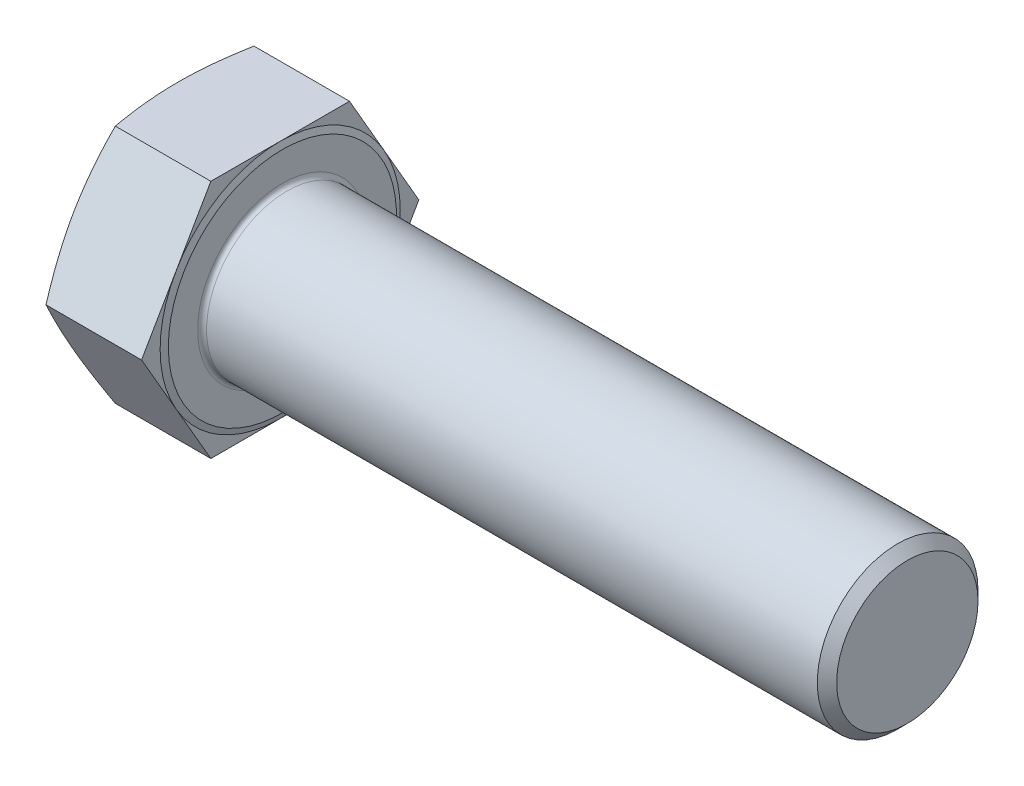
ISO-10303-21;
HEADER;
FILE_DESCRIPTION(('STEP AP214'),'2;1');
FILE_NAME('part.step','',(''),(''),'','','');
FILE_SCHEMA(('AUTOMOTIVE_DESIGN { 1 0 10303 214 1 1 1 1 }'));
ENDSEC;
DATA;
#1=APPLICATION_CONTEXT('core data for automotive mechanical design processes');
#2=APPLICATION_PROTOCOL_DEFINITION('international standard','automotive_design',2000,#1);
#3=PRODUCT_CONTEXT('',#1,'mechanical');
#4=PRODUCT('Part','Part','',(#3));
#5=PRODUCT_RELATED_PRODUCT_CATEGORY('part','',(#4));
#6=PRODUCT_DEFINITION_FORMATION('','',#4);
#7=PRODUCT_DEFINITION_CONTEXT('part definition',#1,'design');
#8=PRODUCT_DEFINITION('design','',#6,#7);
#9=PRODUCT_DEFINITION_SHAPE('','',#8);
#10=(LENGTH_UNIT() NAMED_UNIT(*) SI_UNIT(.MILLI.,.METRE.));
#11=(NAMED_UNIT(*) PLANE_ANGLE_UNIT() SI_UNIT($,.RADIAN.));
#12=(NAMED_UNIT(*) SI_UNIT($,.STERADIAN.) SOLID_ANGLE_UNIT());
#13=UNCERTAINTY_MEASURE_WITH_UNIT(LENGTH_MEASURE(1.E-05),#10,'distance_accuracy_value','');
#14=(GEOMETRIC_REPRESENTATION_CONTEXT(3) GLOBAL_UNCERTAINTY_ASSIGNED_CONTEXT((#13)) GLOBAL_UNIT_ASSIGNED_CONTEXT((#10,
#11,#12)) REPRESENTATION_CONTEXT('',''));
#15=CARTESIAN_POINT('',(0.,0.,0.));
#16=DIRECTION('',(0.,0.,1.));
#17=DIRECTION('',(1.,0.,0.));
#18=AXIS2_PLACEMENT_3D('',#15,#16,#17);
#19=CARTESIAN_POINT('',(23.42,0.,0.));
#20=DIRECTION('',(1.,0.,0.));
#21=DIRECTION('',(0.,0.,-1.));
#22=AXIS2_PLACEMENT_3D('',#19,#20,#21);
#23=PLANE('',#22);
#24=CARTESIAN_POINT('',(23.42,0.,0.));
#25=DIRECTION('',(1.,0.,0.));
#26=DIRECTION('',(0.,0.,-1.));
#27=AXIS2_PLACEMENT_3D('',#24,#25,#26);
#28=CIRCLE('',#27,19.);
#29=CARTESIAN_POINT('',(23.42,0.,-19.));
#30=VERTEX_POINT('',#29);
#31=EDGE_CURVE('E188',#30,#30,#28,.F.);
#32=ORIENTED_EDGE('',*,*,#31,.T.);
#33=EDGE_LOOP('',(#32));
#34=FACE_BOUND('',#33,.T.);
#35=CARTESIAN_POINT('',(23.42,0.,0.));
#36=DIRECTION('',(-1.,0.,0.));
#37=DIRECTION('',(0.,0.,1.));
#38=AXIS2_PLACEMENT_3D('',#35,#36,#37);
#39=CIRCLE('',#38,25.555);
#40=CARTESIAN_POINT('',(23.42,0.,25.555));
#41=VERTEX_POINT('',#40);
#42=EDGE_CURVE('E139',#41,#41,#39,.T.);
#43=ORIENTED_EDGE('',*,*,#42,.F.);
#44=EDGE_LOOP('',(#43));
#45=FACE_BOUND('',#44,.T.);
#46=ADVANCED_FACE('F33',(#34,#45),#23,.T.);
#47=CARTESIAN_POINT('',(22.92,0.,-31.0614444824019));
#48=DIRECTION('',(1.,0.,0.));
#49=DIRECTION('',(0.,0.,-1.));
#50=AXIS2_PLACEMENT_3D('',#47,#48,#49);
#51=PLANE('',#50);
#52=DIRECTION('',(0.,-0.866025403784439,0.5));
#53=VECTOR('',#52,1.);
#54=CARTESIAN_POINT('',(22.92,26.9,15.5307222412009));
#55=LINE('',#54,#53);
#56=CARTESIAN_POINT('',(22.92,26.9,15.5307222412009));
#57=VERTEX_POINT('',#56);
#58=CARTESIAN_POINT('',(22.92,13.45,23.2960833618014));
#59=VERTEX_POINT('',#58);
#60=EDGE_CURVE('E138',#57,#59,#55,.T.);
#61=ORIENTED_EDGE('',*,*,#60,.T.);
#62=CARTESIAN_POINT('',(22.92,0.,0.));
#63=DIRECTION('',(-1.,0.,0.));
#64=DIRECTION('',(0.,0.,1.));
#65=AXIS2_PLACEMENT_3D('',#62,#63,#64);
#66=CIRCLE('',#65,26.9);
#67=CARTESIAN_POINT('',(22.92,26.9,0.));
#68=VERTEX_POINT('',#67);
#69=EDGE_CURVE('E49',#59,#68,#66,.T.);
#70=ORIENTED_EDGE('',*,*,#69,.T.);
#71=DIRECTION('',(0.,0.,1.));
#72=VECTOR('',#71,1.);
#73=CARTESIAN_POINT('',(22.92,26.9,-15.5307222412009));
#74=LINE('',#73,#72);
#75=EDGE_CURVE('E135',#68,#57,#74,.T.);
#76=ORIENTED_EDGE('',*,*,#75,.T.);
#77=EDGE_LOOP('',(#61,#70,#76));
#78=FACE_BOUND('',#77,.T.);
#79=ADVANCED_FACE('F134',(#78),#51,.T.);
#80=CARTESIAN_POINT('',(22.92,26.9,-15.5307222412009));
#81=VERTEX_POINT('',#80);
#82=EDGE_CURVE('E145',#81,#68,#74,.T.);
#83=ORIENTED_EDGE('',*,*,#82,.T.);
#84=CARTESIAN_POINT('',(22.92,13.45,-23.2960833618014));
#85=VERTEX_POINT('',#84);
#86=EDGE_CURVE('E122',#68,#85,#66,.T.);
#87=ORIENTED_EDGE('',*,*,#86,.T.);
#88=DIRECTION('',(0.,0.866025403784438,0.5));
#89=VECTOR('',#88,1.);
#90=CARTESIAN_POINT('',(22.92,0.,-31.0614444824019));
#91=LINE('',#90,#89);
#92=EDGE_CURVE('E151',#85,#81,#91,.T.);
#93=ORIENTED_EDGE('',*,*,#92,.T.);
#94=EDGE_LOOP('',(#83,#87,#93));
#95=FACE_BOUND('',#94,.T.);
#96=ADVANCED_FACE('F150',(#95),#51,.T.);
#97=CARTESIAN_POINT('',(22.92,0.,-31.0614444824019));
#98=VERTEX_POINT('',#97);
#99=EDGE_CURVE('E148',#98,#85,#91,.T.);
#100=ORIENTED_EDGE('',*,*,#99,.T.);
#101=CARTESIAN_POINT('',(22.92,-13.45,-23.2960833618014));
#102=VERTEX_POINT('',#101);
#103=EDGE_CURVE('E125',#85,#102,#66,.T.);
#104=ORIENTED_EDGE('',*,*,#103,.T.);
#105=DIRECTION('',(0.,0.866025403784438,-0.5));
#106=VECTOR('',#105,1.);
#107=CARTESIAN_POINT('',(22.92,-26.9,-15.530722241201));
#108=LINE('',#107,#106);
#109=EDGE_CURVE('E306',#102,#98,#108,.T.);
#110=ORIENTED_EDGE('',*,*,#109,.T.);
#111=EDGE_LOOP('',(#100,#104,#110));
#112=FACE_BOUND('',#111,.T.);
#113=ADVANCED_FACE('F337',(#112),#51,.T.);
#114=CARTESIAN_POINT('',(22.92,-26.9,-15.530722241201));
#115=VERTEX_POINT('',#114);
#116=EDGE_CURVE('E304',#115,#102,#108,.T.);
#117=ORIENTED_EDGE('',*,*,#116,.T.);
#118=CARTESIAN_POINT('',(22.92,-26.9,0.));
#119=VERTEX_POINT('',#118);
#120=EDGE_CURVE('E338',#102,#119,#66,.T.);
#121=ORIENTED_EDGE('',*,*,#120,.T.);
#122=DIRECTION('',(0.,0.,-1.));
#123=VECTOR('',#122,1.);
#124=CARTESIAN_POINT('',(22.92,-26.9,15.5307222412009));
#125=LINE('',#124,#123);
#126=EDGE_CURVE('E162',#119,#115,#125,.T.);
#127=ORIENTED_EDGE('',*,*,#126,.T.);
#128=EDGE_LOOP('',(#117,#121,#127));
#129=FACE_BOUND('',#128,.T.);
#130=ADVANCED_FACE('F352',(#129),#51,.T.);
#131=CARTESIAN_POINT('',(22.92,-26.9,15.5307222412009));
#132=VERTEX_POINT('',#131);
#133=EDGE_CURVE('E163',#132,#119,#125,.T.);
#134=ORIENTED_EDGE('',*,*,#133,.T.);
#135=CARTESIAN_POINT('',(22.92,-13.45,23.2960833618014));
#136=VERTEX_POINT('',#135);
#137=EDGE_CURVE('E339',#119,#136,#66,.T.);
#138=ORIENTED_EDGE('',*,*,#137,.T.);
#139=DIRECTION('',(0.,-0.866025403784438,-0.5));
#140=VECTOR('',#139,1.);
#141=CARTESIAN_POINT('',(22.92,0.,31.0614444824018));
#142=LINE('',#141,#140);
#143=EDGE_CURVE('E158',#136,#132,#142,.T.);
#144=ORIENTED_EDGE('',*,*,#143,.T.);
#145=EDGE_LOOP('',(#134,#138,#144));
#146=FACE_BOUND('',#145,.T.);
#147=ADVANCED_FACE('F347',(#146),#51,.T.);
#148=CARTESIAN_POINT('',(22.92,0.,31.0614444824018));
#149=VERTEX_POINT('',#148);
#150=EDGE_CURVE('E159',#149,#136,#142,.T.);
#151=ORIENTED_EDGE('',*,*,#150,.T.);
#152=EDGE_CURVE('E140',#136,#59,#66,.T.);
#153=ORIENTED_EDGE('',*,*,#152,.T.);
#154=EDGE_CURVE('E153',#59,#149,#55,.T.);
#155=ORIENTED_EDGE('',*,*,#154,.T.);
#156=EDGE_LOOP('',(#151,#153,#155));
#157=FACE_BOUND('',#156,.T.);
#158=ADVANCED_FACE('F213',(#157),#51,.T.);
#159=CARTESIAN_POINT('',(22.92,-26.9,-15.530722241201));
#160=DIRECTION('',(0.,0.5,0.866025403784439));
#161=DIRECTION('',(0.,-0.866025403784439,0.5));
#162=AXIS2_PLACEMENT_3D('',#159,#160,#161);
#163=PLANE('',#162);
#164=CARTESIAN_POINT('',(1.51468395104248,0.000200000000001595,-31.0615599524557));
#165=CARTESIAN_POINT('',(1.397628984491,-0.556880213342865,-30.739929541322));
#166=CARTESIAN_POINT('',(1.2858383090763,-1.11477913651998,-30.4178264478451));
#167=CARTESIAN_POINT('',(1.07394359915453,-2.23229041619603,-29.7726310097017));
#168=CARTESIAN_POINT('',(0.973840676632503,-2.79190293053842,-29.4495385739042));
#169=CARTESIAN_POINT('',(0.692703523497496,-4.47404053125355,-28.4783559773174));
#170=CARTESIAN_POINT('',(0.531005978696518,-5.59909558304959,-27.8288051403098));
#171=CARTESIAN_POINT('',(0.334493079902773,-7.28525346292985,-26.8553014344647));
#172=CARTESIAN_POINT('',(0.276827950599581,-7.84441085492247,-26.5324717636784));
#173=CARTESIAN_POINT('',(0.1772419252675,-8.96379540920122,-25.8861947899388));
#174=CARTESIAN_POINT('',(0.135321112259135,-9.52402257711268,-25.5627474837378));
#175=CARTESIAN_POINT('',(0.0679605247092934,-10.6450156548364,-24.9155418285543));
#176=CARTESIAN_POINT('',(0.0425147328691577,-11.2057812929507,-24.5917836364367));
#177=CARTESIAN_POINT('',(0.00853449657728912,-12.3276979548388,-23.9440447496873));
#178=CARTESIAN_POINT('',(0.,-12.8888489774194,-23.6200640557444));
#179=CARTESIAN_POINT('',(0.,-14.0111510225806,-22.9721026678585));
#180=CARTESIAN_POINT('',(0.00853449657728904,-14.5723020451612,-22.6481219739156));
#181=CARTESIAN_POINT('',(0.0425147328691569,-15.6942187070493,-22.0003830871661));
#182=CARTESIAN_POINT('',(0.0679605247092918,-16.2549843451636,-21.6766248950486));
#183=CARTESIAN_POINT('',(0.135321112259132,-17.3759774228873,-21.029419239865));
#184=CARTESIAN_POINT('',(0.177241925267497,-17.9362045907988,-20.705971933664));
#185=CARTESIAN_POINT('',(0.276827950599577,-19.0555891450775,-20.0596949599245));
#186=CARTESIAN_POINT('',(0.33449307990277,-19.6147465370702,-19.7368652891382));
#187=CARTESIAN_POINT('',(0.531005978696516,-21.3009044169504,-18.7633615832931));
#188=CARTESIAN_POINT('',(0.692703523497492,-22.4259594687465,-18.1138107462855));
#189=CARTESIAN_POINT('',(0.973840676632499,-24.1080970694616,-17.1426281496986));
#190=CARTESIAN_POINT('',(1.07394359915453,-24.667709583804,-16.8195357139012));
#191=CARTESIAN_POINT('',(1.28583830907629,-25.78522086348,-16.1743402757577));
#192=CARTESIAN_POINT('',(1.39762898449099,-26.3431197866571,-15.8522371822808));
#193=CARTESIAN_POINT('',(1.51468395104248,-26.9002,-15.5306067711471));
#194=B_SPLINE_CURVE_WITH_KNOTS('',3,(#164,#165,#166,#167,#168,#169,#170,#171,#172,#173,#174,
#175,#176,#177,#178,#179,#180,#181,#182,#183,#184,#185,#186,#187,#188,#189,#190,#191,#192,#193),
.UNSPECIFIED.,.F.,.F.,(4,2,2,2,2,2,2,2,2,2,2,2,2,2,4),(0.,1.96141494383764,3.92301634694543,
7.84893078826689,9.79346540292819,11.7380102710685,13.6818445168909,15.6256727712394,
17.569501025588,19.5133352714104,21.4578801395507,23.402414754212,27.3283291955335,
29.2899305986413,31.2513455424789),.UNSPECIFIED.);
#195=CARTESIAN_POINT('',(1.51464192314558,0.,-31.0614444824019));
#196=VERTEX_POINT('',#195);
#197=CARTESIAN_POINT('',(0.,-13.45,-23.2960833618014));
#198=VERTEX_POINT('',#197);
#199=EDGE_CURVE('E321',#196,#198,#194,.T.);
#200=ORIENTED_EDGE('',*,*,#199,.F.);
#201=DIRECTION('',(-1.,0.,0.));
#202=VECTOR('',#201,1.);
#203=CARTESIAN_POINT('',(22.92,0.,-31.0614444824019));
#204=LINE('',#203,#202);
#205=EDGE_CURVE('E178',#98,#196,#204,.T.);
#206=ORIENTED_EDGE('',*,*,#205,.F.);
#207=ORIENTED_EDGE('',*,*,#109,.F.);
#208=ORIENTED_EDGE('',*,*,#116,.F.);
#209=DIRECTION('',(-1.,0.,0.));
#210=VECTOR('',#209,1.);
#211=CARTESIAN_POINT('',(22.92,-26.9,-15.530722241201));
#212=LINE('',#211,#210);
#213=CARTESIAN_POINT('',(1.51464192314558,-26.9,-15.530722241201));
#214=VERTEX_POINT('',#213);
#215=EDGE_CURVE('E166',#115,#214,#212,.T.);
#216=ORIENTED_EDGE('',*,*,#215,.T.);
#217=EDGE_CURVE('E246',#198,#214,#194,.T.);
#218=ORIENTED_EDGE('',*,*,#217,.F.);
#219=EDGE_LOOP('',(#200,#206,#207,#208,#216,#218));
#220=FACE_BOUND('',#219,.T.);
#221=ADVANCED_FACE('F35',(#220),#163,.F.);
#222=CARTESIAN_POINT('',(22.92,0.,-31.0614444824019));
#223=DIRECTION('',(0.,-0.5,0.866025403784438));
#224=DIRECTION('',(0.,-0.866025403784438,-0.5));
#225=AXIS2_PLACEMENT_3D('',#222,#223,#224);
#226=PLANE('',#225);
#227=CARTESIAN_POINT('',(1.51468395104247,26.9002,-15.5306067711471));
#228=CARTESIAN_POINT('',(1.39762898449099,26.3431197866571,-15.8522371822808));
#229=CARTESIAN_POINT('',(1.28583830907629,25.78522086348,-16.1743402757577));
#230=CARTESIAN_POINT('',(1.07394359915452,24.667709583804,-16.8195357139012));
#231=CARTESIAN_POINT('',(0.973840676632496,24.1080970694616,-17.1426281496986));
#232=CARTESIAN_POINT('',(0.69270352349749,22.4259594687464,-18.1138107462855));
#233=CARTESIAN_POINT('',(0.531005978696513,21.3009044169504,-18.7633615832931));
#234=CARTESIAN_POINT('',(0.334493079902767,19.6147465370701,-19.7368652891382));
#235=CARTESIAN_POINT('',(0.276827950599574,19.0555891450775,-20.0596949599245));
#236=CARTESIAN_POINT('',(0.177241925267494,17.9362045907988,-20.705971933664));
#237=CARTESIAN_POINT('',(0.135321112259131,17.3759774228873,-21.029419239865));
#238=CARTESIAN_POINT('',(0.0679605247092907,16.2549843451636,-21.6766248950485));
#239=CARTESIAN_POINT('',(0.0425147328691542,15.6942187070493,-22.0003830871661));
#240=CARTESIAN_POINT('',(0.00853449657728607,14.5723020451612,-22.6481219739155));
#241=CARTESIAN_POINT('',(0.,14.0111510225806,-22.9721026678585));
#242=CARTESIAN_POINT('',(0.,12.8888489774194,-23.6200640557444));
#243=CARTESIAN_POINT('',(0.00853449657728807,12.3276979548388,-23.9440447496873));
#244=CARTESIAN_POINT('',(0.0425147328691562,11.2057812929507,-24.5917836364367));
#245=CARTESIAN_POINT('',(0.0679605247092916,10.6450156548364,-24.9155418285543));
#246=CARTESIAN_POINT('',(0.135321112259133,9.52402257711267,-25.5627474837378));
#247=CARTESIAN_POINT('',(0.177241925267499,8.96379540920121,-25.8861947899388));
#248=CARTESIAN_POINT('',(0.27682795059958,7.84441085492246,-26.5324717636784));
#249=CARTESIAN_POINT('',(0.334493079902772,7.28525346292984,-26.8553014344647));
#250=CARTESIAN_POINT('',(0.531005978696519,5.59909558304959,-27.8288051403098));
#251=CARTESIAN_POINT('',(0.692703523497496,4.47404053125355,-28.4783559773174));
#252=CARTESIAN_POINT('',(0.973840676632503,2.79190293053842,-29.4495385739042));
#253=CARTESIAN_POINT('',(1.07394359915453,2.23229041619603,-29.7726310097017));
#254=CARTESIAN_POINT('',(1.2858383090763,1.11477913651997,-30.4178264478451));
#255=CARTESIAN_POINT('',(1.397628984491,0.556880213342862,-30.739929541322));
#256=CARTESIAN_POINT('',(1.51468395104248,-0.000200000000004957,-31.0615599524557));
#257=B_SPLINE_CURVE_WITH_KNOTS('',3,(#227,#228,#229,#230,#231,#232,#233,#234,#235,#236,#237,
#238,#239,#240,#241,#242,#243,#244,#245,#246,#247,#248,#249,#250,#251,#252,#253,#254,#255,#256),
.UNSPECIFIED.,.F.,.F.,(4,2,2,2,2,2,2,2,2,2,2,2,2,2,4),(0.,1.96141494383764,3.92301634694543,
7.84893078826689,9.79346540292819,11.7380102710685,13.6818445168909,15.6256727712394,
17.569501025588,19.5133352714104,21.4578801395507,23.402414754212,27.3283291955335,
29.2899305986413,31.2513455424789),.UNSPECIFIED.);
#258=CARTESIAN_POINT('',(1.51464192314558,26.9,-15.530722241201));
#259=VERTEX_POINT('',#258);
#260=CARTESIAN_POINT('',(0.,13.45,-23.2960833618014));
#261=VERTEX_POINT('',#260);
#262=EDGE_CURVE('E261',#259,#261,#257,.T.);
#263=ORIENTED_EDGE('',*,*,#262,.F.);
#264=DIRECTION('',(-1.,0.,0.));
#265=VECTOR('',#264,1.);
#266=CARTESIAN_POINT('',(22.92,26.9,-15.5307222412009));
#267=LINE('',#266,#265);
#268=EDGE_CURVE('E176',#81,#259,#267,.T.);
#269=ORIENTED_EDGE('',*,*,#268,.F.);
#270=ORIENTED_EDGE('',*,*,#92,.F.);
#271=ORIENTED_EDGE('',*,*,#99,.F.);
#272=ORIENTED_EDGE('',*,*,#205,.T.);
#273=EDGE_CURVE('E257',#261,#196,#257,.T.);
#274=ORIENTED_EDGE('',*,*,#273,.F.);
#275=EDGE_LOOP('',(#263,#269,#270,#271,#272,#274));
#276=FACE_BOUND('',#275,.T.);
#277=ADVANCED_FACE('F267',(#276),#226,.F.);
#278=CARTESIAN_POINT('',(22.92,26.9,-15.5307222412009));
#279=DIRECTION('',(0.,-1.,0.));
#280=DIRECTION('',(0.,0.,-1.));
#281=AXIS2_PLACEMENT_3D('',#278,#279,#280);
#282=PLANE('',#281);
#283=CARTESIAN_POINT('',(8.09364576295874,26.9,-41.1198915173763));
#284=CARTESIAN_POINT('',(7.90830433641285,26.9,-40.5113738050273));
#285=CARTESIAN_POINT('',(7.72408376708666,26.9,-39.9025148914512));
#286=CARTESIAN_POINT('',(7.35813527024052,26.9,-38.6840447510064));
#287=CARTESIAN_POINT('',(7.17640735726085,26.9,-38.0744335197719));
#288=CARTESIAN_POINT('',(6.63531556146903,26.9,-36.2442869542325));
#289=CARTESIAN_POINT('',(6.28007109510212,26.9,-35.0225286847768));
#290=CARTESIAN_POINT('',(5.58244747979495,26.9,-32.5728705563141));
#291=CARTESIAN_POINT('',(5.24009357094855,26.9,-31.3449634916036));
#292=CARTESIAN_POINT('',(4.5722297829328,26.9,-28.8845822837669));
#293=CARTESIAN_POINT('',(4.24671960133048,26.9,-27.6521082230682));
#294=CARTESIAN_POINT('',(3.62060798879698,26.9,-25.197000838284));
#295=CARTESIAN_POINT('',(3.31974892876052,26.9,-23.9744335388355));
#296=CARTESIAN_POINT('',(2.74364501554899,26.9,-21.5232150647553));
#297=CARTESIAN_POINT('',(2.46840059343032,26.9,-20.2945637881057));
#298=CARTESIAN_POINT('',(1.94994322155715,26.9,-17.830903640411));
#299=CARTESIAN_POINT('',(1.70671934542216,26.9,-16.5958970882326));
#300=CARTESIAN_POINT('',(1.2597103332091,26.9,-14.1187102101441));
#301=CARTESIAN_POINT('',(1.05592387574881,26.9,-12.8765301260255));
#302=CARTESIAN_POINT('',(0.716241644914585,26.9,-10.5248872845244));
#303=CARTESIAN_POINT('',(0.575295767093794,26.9,-9.41615943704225));
#304=CARTESIAN_POINT('',(0.336719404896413,26.9,-7.1939724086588));
#305=CARTESIAN_POINT('',(0.239087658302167,26.9,-6.08051336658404));
#306=CARTESIAN_POINT('',(0.128593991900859,26.9,-4.40838470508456));
#307=CARTESIAN_POINT('',(0.0977591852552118,26.9,-3.85086246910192));
#308=CARTESIAN_POINT('',(0.0484239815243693,26.9,-2.73527685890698));
#309=CARTESIAN_POINT('',(0.0299232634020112,26.9,-2.17721349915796));
#310=CARTESIAN_POINT('',(0.0055107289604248,26.9,-1.06080724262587));
#311=CARTESIAN_POINT('',(-0.000400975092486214,26.9,-0.502464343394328));
#312=CARTESIAN_POINT('',(0.000443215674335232,26.9,0.614211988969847));
#313=CARTESIAN_POINT('',(0.00719911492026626,26.9,1.17254542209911));
#314=CARTESIAN_POINT('',(0.0333546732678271,26.9,2.29174099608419));
#315=CARTESIAN_POINT('',(0.0528180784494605,26.9,2.85260165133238));
#316=CARTESIAN_POINT('',(0.104180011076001,26.9,3.97375773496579));
#317=CARTESIAN_POINT('',(0.136078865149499,26.9,4.5340531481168));
#318=CARTESIAN_POINT('',(0.249841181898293,26.9,6.21369861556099));
#319=CARTESIAN_POINT('',(0.349771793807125,26.9,7.331864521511));
#320=CARTESIAN_POINT('',(0.593196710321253,26.9,9.56430663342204));
#321=CARTESIAN_POINT('',(0.736728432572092,26.9,10.6785786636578));
#322=CARTESIAN_POINT('',(1.06151792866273,26.9,12.9015599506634));
#323=CARTESIAN_POINT('',(1.24277590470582,26.9,14.0102691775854));
#324=CARTESIAN_POINT('',(1.64755311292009,26.9,16.2804519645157));
#325=CARTESIAN_POINT('',(1.87280061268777,26.9,17.4416144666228));
#326=CARTESIAN_POINT('',(2.35228601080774,26.9,19.7579775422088));
#327=CARTESIAN_POINT('',(2.60652609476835,26.9,20.9131776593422));
#328=CARTESIAN_POINT('',(3.13865846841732,26.9,23.2184379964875));
#329=CARTESIAN_POINT('',(3.41655762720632,26.9,24.3684966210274));
#330=CARTESIAN_POINT('',(3.99148746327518,26.9,26.6637692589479));
#331=CARTESIAN_POINT('',(4.28851768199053,26.9,27.8089833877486));
#332=CARTESIAN_POINT('',(4.89852507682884,26.9,30.0967168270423));
#333=CARTESIAN_POINT('',(5.21152224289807,26.9,31.2392307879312));
#334=CARTESIAN_POINT('',(5.85024897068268,26.9,33.5206892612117));
#335=CARTESIAN_POINT('',(6.17597858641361,26.9,34.6596337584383));
#336=CARTESIAN_POINT('',(6.83783976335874,26.9,36.9342824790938));
#337=CARTESIAN_POINT('',(7.1739695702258,26.9,38.069987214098));
#338=CARTESIAN_POINT('',(7.85487614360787,26.9,40.338794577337));
#339=CARTESIAN_POINT('',(8.19965289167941,26.9,41.4718972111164));
#340=CARTESIAN_POINT('',(8.89256675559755,26.9,43.7233837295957));
#341=CARTESIAN_POINT('',(9.24062474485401,26.9,44.8417919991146));
#342=CARTESIAN_POINT('',(9.94266960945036,26.9,47.0767443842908));
#343=CARTESIAN_POINT('',(10.2966564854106,26.9,48.193288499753));
#344=CARTESIAN_POINT('',(11.009668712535,26.9,50.4248218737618));
#345=CARTESIAN_POINT('',(11.3686942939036,26.9,51.5398110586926));
#346=CARTESIAN_POINT('',(12.0910295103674,26.9,53.7684011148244));
#347=CARTESIAN_POINT('',(12.4543391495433,26.9,54.8820019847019));
#348=CARTESIAN_POINT('',(13.1832494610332,26.9,57.1037718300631));
#349=CARTESIAN_POINT('',(13.5488362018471,26.9,58.211945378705));
#350=CARTESIAN_POINT('',(14.2831644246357,26.9,60.4272469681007));
#351=CARTESIAN_POINT('',(14.6519059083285,26.9,61.5343750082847));
#352=CARTESIAN_POINT('',(15.3920975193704,26.9,63.7476240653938));
#353=CARTESIAN_POINT('',(15.763547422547,26.9,64.8537451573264));
#354=CARTESIAN_POINT('',(16.5088507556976,26.9,67.065174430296));
#355=CARTESIAN_POINT('',(16.8827041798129,26.9,68.1704826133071));
#356=CARTESIAN_POINT('',(17.2575927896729,26.9,69.2754387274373));
#357=B_SPLINE_CURVE_WITH_KNOTS('',3,(#283,#284,#285,#286,#287,#288,#289,#290,#291,#292,#293,
#294,#295,#296,#297,#298,#299,#300,#301,#302,#303,#304,#305,#306,#307,#308,#309,#310,#311,#312,
#313,#314,#315,#316,#317,#318,#319,#320,#321,#322,#323,#324,#325,#326,#327,#328,#329,#330,#331,
#332,#333,#334,#335,#336,#337,#338,#339,#340,#341,#342,#343,#344,#345,#346,#347,#348,#349,#350,
#351,#352,#353,#354,#355,#356),.UNSPECIFIED.,.F.,.F.,(4,2,2,2,2,2,2,2,2,2,2,2,2,2,2,2,2,2,2,2,2,
2,2,2,2,2,2,2,2,2,2,2,2,2,2,2,4),(0.,1.90834994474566,3.81671101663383,7.63371526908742,
11.4578411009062,15.2818982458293,19.0588067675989,22.8357788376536,26.6114587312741,
30.3870120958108,33.7392539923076,37.0913981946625,38.7664069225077,40.4413720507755,
42.1163521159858,43.7913327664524,45.4747810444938,47.1582735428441,50.5250887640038,
53.8948015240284,57.2645323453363,60.8125045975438,64.3607444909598,67.9100181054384,
71.459206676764,75.0129532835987,78.5667149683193,82.119880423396,85.6730383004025,
89.1869673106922,92.700896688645,96.214987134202,99.7290809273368,103.229835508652,
106.730591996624,110.231061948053,113.731523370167),.UNSPECIFIED.);
#358=CARTESIAN_POINT('',(1.51464192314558,26.9000000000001,15.5307222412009));
#359=VERTEX_POINT('',#358);
#360=CARTESIAN_POINT('',(0.,26.9,0.));
#361=VERTEX_POINT('',#360);
#362=EDGE_CURVE('E57',#359,#361,#357,.F.);
#363=ORIENTED_EDGE('',*,*,#362,.F.);
#364=DIRECTION('',(-1.,0.,0.));
#365=VECTOR('',#364,1.);
#366=CARTESIAN_POINT('',(22.92,26.9,15.5307222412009));
#367=LINE('',#366,#365);
#368=EDGE_CURVE('E147',#57,#359,#367,.T.);
#369=ORIENTED_EDGE('',*,*,#368,.F.);
#370=ORIENTED_EDGE('',*,*,#75,.F.);
#371=ORIENTED_EDGE('',*,*,#82,.F.);
#372=ORIENTED_EDGE('',*,*,#268,.T.);
#373=EDGE_CURVE('E262',#361,#259,#357,.F.);
#374=ORIENTED_EDGE('',*,*,#373,.F.);
#375=EDGE_LOOP('',(#363,#369,#370,#371,#372,#374));
#376=FACE_BOUND('',#375,.T.);
#377=ADVANCED_FACE('F143',(#376),#282,.F.);
#378=CARTESIAN_POINT('',(22.92,26.9,15.5307222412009));
#379=DIRECTION('',(0.,-0.5,-0.866025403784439));
#380=DIRECTION('',(0.,0.866025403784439,-0.5));
#381=AXIS2_PLACEMENT_3D('',#378,#379,#380);
#382=PLANE('',#381);
#383=CARTESIAN_POINT('',(1.51468395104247,-0.000199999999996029,31.0615599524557));
#384=CARTESIAN_POINT('',(1.39762898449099,0.556880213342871,30.739929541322));
#385=CARTESIAN_POINT('',(1.28583830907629,1.11477913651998,30.4178264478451));
#386=CARTESIAN_POINT('',(1.07394359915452,2.23229041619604,29.7726310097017));
#387=CARTESIAN_POINT('',(0.973840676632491,2.79190293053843,29.4495385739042));
#388=CARTESIAN_POINT('',(0.692703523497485,4.47404053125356,28.4783559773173));
#389=CARTESIAN_POINT('',(0.531005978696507,5.5990955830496,27.8288051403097));
#390=CARTESIAN_POINT('',(0.33449307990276,7.28525346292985,26.8553014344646));
#391=CARTESIAN_POINT('',(0.276827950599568,7.84441085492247,26.5324717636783));
#392=CARTESIAN_POINT('',(0.177241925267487,8.96379540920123,25.8861947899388));
#393=CARTESIAN_POINT('',(0.135321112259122,9.52402257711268,25.5627474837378));
#394=CARTESIAN_POINT('',(0.0679605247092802,10.6450156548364,24.9155418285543));
#395=CARTESIAN_POINT('',(0.042514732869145,11.2057812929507,24.5917836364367));
#396=CARTESIAN_POINT('',(0.00853449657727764,12.3276979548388,23.9440447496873));
#397=CARTESIAN_POINT('',(0.,12.8888489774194,23.6200640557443));
#398=CARTESIAN_POINT('',(0.,14.0111510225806,22.9721026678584));
#399=CARTESIAN_POINT('',(0.0085344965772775,14.5723020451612,22.6481219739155));
#400=CARTESIAN_POINT('',(0.0425147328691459,15.6942187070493,22.0003830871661));
#401=CARTESIAN_POINT('',(0.0679605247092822,16.2549843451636,21.6766248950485));
#402=CARTESIAN_POINT('',(0.135321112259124,17.3759774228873,21.029419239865));
#403=CARTESIAN_POINT('',(0.177241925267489,17.9362045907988,20.705971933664));
#404=CARTESIAN_POINT('',(0.27682795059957,19.0555891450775,20.0596949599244));
#405=CARTESIAN_POINT('',(0.334493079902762,19.6147465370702,19.7368652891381));
#406=CARTESIAN_POINT('',(0.531005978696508,21.3009044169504,18.763361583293));
#407=CARTESIAN_POINT('',(0.692703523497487,22.4259594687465,18.1138107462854));
#408=CARTESIAN_POINT('',(0.973840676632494,24.1080970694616,17.1426281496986));
#409=CARTESIAN_POINT('',(1.07394359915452,24.667709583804,16.8195357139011));
#410=CARTESIAN_POINT('',(1.28583830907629,25.78522086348,16.1743402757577));
#411=CARTESIAN_POINT('',(1.39762898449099,26.3431197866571,15.8522371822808));
#412=CARTESIAN_POINT('',(1.51468395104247,26.9002,15.5306067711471));
#413=B_SPLINE_CURVE_WITH_KNOTS('',3,(#383,#384,#385,#386,#387,#388,#389,#390,#391,#392,#393,
#394,#395,#396,#397,#398,#399,#400,#401,#402,#403,#404,#405,#406,#407,#408,#409,#410,#411,#412),
.UNSPECIFIED.,.F.,.F.,(4,2,2,2,2,2,2,2,2,2,2,2,2,2,4),(0.,1.96141494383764,3.92301634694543,
7.84893078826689,9.79346540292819,11.7380102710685,13.6818445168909,15.6256727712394,
17.569501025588,19.5133352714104,21.4578801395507,23.402414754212,27.3283291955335,
29.2899305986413,31.2513455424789),.UNSPECIFIED.);
#414=CARTESIAN_POINT('',(1.51464192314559,0.,31.0614444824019));
#415=VERTEX_POINT('',#414);
#416=CARTESIAN_POINT('',(0.,13.45,23.2960833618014));
#417=VERTEX_POINT('',#416);
#418=EDGE_CURVE('E251',#415,#417,#413,.T.);
#419=ORIENTED_EDGE('',*,*,#418,.F.);
#420=DIRECTION('',(-1.,0.,0.));
#421=VECTOR('',#420,1.);
#422=CARTESIAN_POINT('',(22.92,0.,31.0614444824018));
#423=LINE('',#422,#421);
#424=EDGE_CURVE('E172',#149,#415,#423,.T.);
#425=ORIENTED_EDGE('',*,*,#424,.F.);
#426=ORIENTED_EDGE('',*,*,#154,.F.);
#427=ORIENTED_EDGE('',*,*,#60,.F.);
#428=ORIENTED_EDGE('',*,*,#368,.T.);
#429=EDGE_CURVE('E312',#417,#359,#413,.T.);
#430=ORIENTED_EDGE('',*,*,#429,.F.);
#431=EDGE_LOOP('',(#419,#425,#426,#427,#428,#430));
#432=FACE_BOUND('',#431,.T.);
#433=ADVANCED_FACE('F273',(#432),#382,.F.);
#434=CARTESIAN_POINT('',(22.92,0.,31.0614444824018));
#435=DIRECTION('',(0.,0.5,-0.866025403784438));
#436=DIRECTION('',(0.,0.866025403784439,0.5));
#437=AXIS2_PLACEMENT_3D('',#434,#435,#436);
#438=PLANE('',#437);
#439=CARTESIAN_POINT('',(1.51468395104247,-26.9002,15.5306067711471));
#440=CARTESIAN_POINT('',(1.39762898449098,-26.3431197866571,15.8522371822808));
#441=CARTESIAN_POINT('',(1.28583830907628,-25.78522086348,16.1743402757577));
#442=CARTESIAN_POINT('',(1.07394359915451,-24.667709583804,16.8195357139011));
#443=CARTESIAN_POINT('',(0.973840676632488,-24.1080970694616,17.1426281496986));
#444=CARTESIAN_POINT('',(0.692703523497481,-22.4259594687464,18.1138107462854));
#445=CARTESIAN_POINT('',(0.531005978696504,-21.3009044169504,18.763361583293));
#446=CARTESIAN_POINT('',(0.334493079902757,-19.6147465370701,19.7368652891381));
#447=CARTESIAN_POINT('',(0.276827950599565,-19.0555891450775,20.0596949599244));
#448=CARTESIAN_POINT('',(0.177241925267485,-17.9362045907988,20.705971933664));
#449=CARTESIAN_POINT('',(0.135321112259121,-17.3759774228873,21.029419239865));
#450=CARTESIAN_POINT('',(0.06796052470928,-16.2549843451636,21.6766248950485));
#451=CARTESIAN_POINT('',(0.0425147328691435,-15.6942187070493,22.0003830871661));
#452=CARTESIAN_POINT('',(0.00853449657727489,-14.5723020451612,22.6481219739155));
#453=CARTESIAN_POINT('',(0.,-14.0111510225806,22.9721026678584));
#454=CARTESIAN_POINT('',(0.,-12.8888489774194,23.6200640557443));
#455=CARTESIAN_POINT('',(0.00853449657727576,-12.3276979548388,23.9440447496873));
#456=CARTESIAN_POINT('',(0.0425147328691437,-11.2057812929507,24.5917836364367));
#457=CARTESIAN_POINT('',(0.0679605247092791,-10.6450156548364,24.9155418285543));
#458=CARTESIAN_POINT('',(0.13532111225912,-9.52402257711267,25.5627474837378));
#459=CARTESIAN_POINT('',(0.177241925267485,-8.96379540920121,25.8861947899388));
#460=CARTESIAN_POINT('',(0.276827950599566,-7.84441085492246,26.5324717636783));
#461=CARTESIAN_POINT('',(0.334493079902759,-7.28525346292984,26.8553014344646));
#462=CARTESIAN_POINT('',(0.531005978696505,-5.59909558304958,27.8288051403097));
#463=CARTESIAN_POINT('',(0.692703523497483,-4.47404053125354,28.4783559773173));
#464=CARTESIAN_POINT('',(0.97384067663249,-2.79190293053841,29.4495385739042));
#465=CARTESIAN_POINT('',(1.07394359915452,-2.23229041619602,29.7726310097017));
#466=CARTESIAN_POINT('',(1.28583830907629,-1.11477913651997,30.4178264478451));
#467=CARTESIAN_POINT('',(1.39762898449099,-0.556880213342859,30.739929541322));
#468=CARTESIAN_POINT('',(1.51468395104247,0.000200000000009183,31.0615599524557));
#469=B_SPLINE_CURVE_WITH_KNOTS('',3,(#439,#440,#441,#442,#443,#444,#445,#446,#447,#448,#449,
#450,#451,#452,#453,#454,#455,#456,#457,#458,#459,#460,#461,#462,#463,#464,#465,#466,#467,#468),
.UNSPECIFIED.,.F.,.F.,(4,2,2,2,2,2,2,2,2,2,2,2,2,2,4),(0.,1.96141494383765,3.92301634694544,
7.84893078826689,9.79346540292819,11.7380102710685,13.6818445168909,15.6256727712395,
17.569501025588,19.5133352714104,21.4578801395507,23.402414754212,27.3283291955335,
29.2899305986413,31.2513455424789),.UNSPECIFIED.);
#470=CARTESIAN_POINT('',(1.51464192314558,-26.9,15.530722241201));
#471=VERTEX_POINT('',#470);
#472=CARTESIAN_POINT('',(0.,-13.45,23.2960833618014));
#473=VERTEX_POINT('',#472);
#474=EDGE_CURVE('E239',#471,#473,#469,.T.);
#475=ORIENTED_EDGE('',*,*,#474,.F.);
#476=DIRECTION('',(-1.,0.,0.));
#477=VECTOR('',#476,1.);
#478=CARTESIAN_POINT('',(22.92,-26.9,15.5307222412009));
#479=LINE('',#478,#477);
#480=EDGE_CURVE('E169',#132,#471,#479,.T.);
#481=ORIENTED_EDGE('',*,*,#480,.F.);
#482=ORIENTED_EDGE('',*,*,#143,.F.);
#483=ORIENTED_EDGE('',*,*,#150,.F.);
#484=ORIENTED_EDGE('',*,*,#424,.T.);
#485=EDGE_CURVE('E317',#473,#415,#469,.T.);
#486=ORIENTED_EDGE('',*,*,#485,.F.);
#487=EDGE_LOOP('',(#475,#481,#482,#483,#484,#486));
#488=FACE_BOUND('',#487,.T.);
#489=ADVANCED_FACE('F276',(#488),#438,.F.);
#490=CARTESIAN_POINT('',(22.92,-26.9,15.5307222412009));
#491=DIRECTION('',(0.,1.,0.));
#492=DIRECTION('',(0.,0.,1.));
#493=AXIS2_PLACEMENT_3D('',#490,#491,#492);
#494=PLANE('',#493);
#495=CARTESIAN_POINT('',(8.09364576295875,-26.9,-41.1198915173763));
#496=CARTESIAN_POINT('',(7.90830433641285,-26.9,-40.5113738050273));
#497=CARTESIAN_POINT('',(7.72408376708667,-26.9,-39.9025148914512));
#498=CARTESIAN_POINT('',(7.35813527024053,-26.9,-38.6840447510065));
#499=CARTESIAN_POINT('',(7.17640735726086,-26.9,-38.0744335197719));
#500=CARTESIAN_POINT('',(6.63531556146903,-26.9,-36.2442869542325));
#501=CARTESIAN_POINT('',(6.28007109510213,-26.9,-35.0225286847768));
#502=CARTESIAN_POINT('',(5.58244747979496,-26.9,-32.5728705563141));
#503=CARTESIAN_POINT('',(5.24009357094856,-26.9,-31.3449634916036));
#504=CARTESIAN_POINT('',(4.5722297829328,-26.9,-28.8845822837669));
#505=CARTESIAN_POINT('',(4.24671960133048,-26.9,-27.6521082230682));
#506=CARTESIAN_POINT('',(3.62060798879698,-26.9,-25.197000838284));
#507=CARTESIAN_POINT('',(3.31974892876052,-26.9,-23.9744335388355));
#508=CARTESIAN_POINT('',(2.74364501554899,-26.9,-21.5232150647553));
#509=CARTESIAN_POINT('',(2.46840059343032,-26.9,-20.2945637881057));
#510=CARTESIAN_POINT('',(1.94994322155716,-26.9,-17.830903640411));
#511=CARTESIAN_POINT('',(1.70671934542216,-26.9,-16.5958970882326));
#512=CARTESIAN_POINT('',(1.2597103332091,-26.9,-14.1187102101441));
#513=CARTESIAN_POINT('',(1.05592387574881,-26.9,-12.8765301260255));
#514=CARTESIAN_POINT('',(0.716241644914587,-26.9,-10.5248872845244));
#515=CARTESIAN_POINT('',(0.575295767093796,-26.9,-9.41615943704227));
#516=CARTESIAN_POINT('',(0.336719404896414,-26.9,-7.19397240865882));
#517=CARTESIAN_POINT('',(0.239087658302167,-26.9,-6.08051336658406));
#518=CARTESIAN_POINT('',(0.12859399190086,-26.9,-4.40838470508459));
#519=CARTESIAN_POINT('',(0.0977591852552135,-26.9,-3.85086246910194));
#520=CARTESIAN_POINT('',(0.048423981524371,-26.9,-2.73527685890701));
#521=CARTESIAN_POINT('',(0.0299232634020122,-26.9,-2.17721349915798));
#522=CARTESIAN_POINT('',(0.0055107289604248,-26.9,-1.06080724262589));
#523=CARTESIAN_POINT('',(-0.000400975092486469,-26.9,-0.502464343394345));
#524=CARTESIAN_POINT('',(0.000443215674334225,-26.9,0.614211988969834));
#525=CARTESIAN_POINT('',(0.00719911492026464,-26.9,1.1725454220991));
#526=CARTESIAN_POINT('',(0.0333546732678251,-26.9,2.29174099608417));
#527=CARTESIAN_POINT('',(0.0528180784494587,-26.9,2.85260165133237));
#528=CARTESIAN_POINT('',(0.104180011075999,-26.9,3.97375773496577));
#529=CARTESIAN_POINT('',(0.136078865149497,-26.9,4.53405314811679));
#530=CARTESIAN_POINT('',(0.249841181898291,-26.9,6.21369861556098));
#531=CARTESIAN_POINT('',(0.349771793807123,-26.9,7.33186452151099));
#532=CARTESIAN_POINT('',(0.593196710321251,-26.9,9.56430663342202));
#533=CARTESIAN_POINT('',(0.736728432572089,-26.9,10.6785786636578));
#534=CARTESIAN_POINT('',(1.06151792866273,-26.9,12.9015599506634));
#535=CARTESIAN_POINT('',(1.24277590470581,-26.9,14.0102691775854));
#536=CARTESIAN_POINT('',(1.64755311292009,-26.9,16.2804519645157));
#537=CARTESIAN_POINT('',(1.87280061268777,-26.9,17.4416144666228));
#538=CARTESIAN_POINT('',(2.35228601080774,-26.9,19.7579775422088));
#539=CARTESIAN_POINT('',(2.60652609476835,-26.9,20.9131776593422));
#540=CARTESIAN_POINT('',(3.13865846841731,-26.9,23.2184379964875));
#541=CARTESIAN_POINT('',(3.41655762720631,-26.9,24.3684966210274));
#542=CARTESIAN_POINT('',(3.99148746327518,-26.9,26.6637692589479));
#543=CARTESIAN_POINT('',(4.28851768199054,-26.9,27.8089833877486));
#544=CARTESIAN_POINT('',(4.89852507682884,-26.9,30.0967168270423));
#545=CARTESIAN_POINT('',(5.21152224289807,-26.9,31.2392307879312));
#546=CARTESIAN_POINT('',(5.85024897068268,-26.9,33.5206892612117));
#547=CARTESIAN_POINT('',(6.17597858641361,-26.9,34.6596337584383));
#548=CARTESIAN_POINT('',(6.83783976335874,-26.9,36.9342824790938));
#549=CARTESIAN_POINT('',(7.1739695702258,-26.9,38.069987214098));
#550=CARTESIAN_POINT('',(7.85487614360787,-26.9,40.338794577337));
#551=CARTESIAN_POINT('',(8.19965289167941,-26.9,41.4718972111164));
#552=CARTESIAN_POINT('',(8.89256675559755,-26.9,43.7233837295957));
#553=CARTESIAN_POINT('',(9.24062474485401,-26.9,44.8417919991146));
#554=CARTESIAN_POINT('',(9.94266960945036,-26.9,47.0767443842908));
#555=CARTESIAN_POINT('',(10.2966564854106,-26.9,48.193288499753));
#556=CARTESIAN_POINT('',(11.009668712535,-26.9,50.4248218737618));
#557=CARTESIAN_POINT('',(11.3686942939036,-26.9,51.5398110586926));
#558=CARTESIAN_POINT('',(12.0910295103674,-26.9,53.7684011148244));
#559=CARTESIAN_POINT('',(12.4543391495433,-26.9,54.8820019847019));
#560=CARTESIAN_POINT('',(13.1832494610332,-26.9,57.1037718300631));
#561=CARTESIAN_POINT('',(13.5488362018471,-26.9,58.211945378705));
#562=CARTESIAN_POINT('',(14.2831644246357,-26.9,60.4272469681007));
#563=CARTESIAN_POINT('',(14.6519059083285,-26.9,61.5343750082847));
#564=CARTESIAN_POINT('',(15.3920975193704,-26.9,63.7476240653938));
#565=CARTESIAN_POINT('',(15.763547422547,-26.9,64.8537451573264));
#566=CARTESIAN_POINT('',(16.5088507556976,-26.9,67.065174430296));
#567=CARTESIAN_POINT('',(16.8827041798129,-26.9,68.1704826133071));
#568=CARTESIAN_POINT('',(17.2575927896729,-26.9,69.2754387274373));
#569=B_SPLINE_CURVE_WITH_KNOTS('',3,(#495,#496,#497,#498,#499,#500,#501,#502,#503,#504,#505,
#506,#507,#508,#509,#510,#511,#512,#513,#514,#515,#516,#517,#518,#519,#520,#521,#522,#523,#524,
#525,#526,#527,#528,#529,#530,#531,#532,#533,#534,#535,#536,#537,#538,#539,#540,#541,#542,#543,
#544,#545,#546,#547,#548,#549,#550,#551,#552,#553,#554,#555,#556,#557,#558,#559,#560,#561,#562,
#563,#564,#565,#566,#567,#568),.UNSPECIFIED.,.F.,.F.,(4,2,2,2,2,2,2,2,2,2,2,2,2,2,2,2,2,2,2,2,2,
2,2,2,2,2,2,2,2,2,2,2,2,2,2,2,4),(0.,1.90834994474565,3.81671101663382,7.63371526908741,
11.4578411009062,15.2818982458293,19.0588067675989,22.8357788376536,26.6114587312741,
30.3870120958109,33.7392539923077,37.0913981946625,38.7664069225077,40.4413720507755,
42.1163521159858,43.7913327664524,45.4747810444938,47.1582735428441,50.5250887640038,
53.8948015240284,57.2645323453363,60.8125045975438,64.3607444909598,67.9100181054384,
71.459206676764,75.0129532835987,78.5667149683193,82.119880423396,85.6730383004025,
89.1869673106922,92.700896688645,96.214987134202,99.7290809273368,103.229835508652,
106.730591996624,110.231061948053,113.731523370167),.UNSPECIFIED.);
#570=CARTESIAN_POINT('',(0.,-26.9,0.));
#571=VERTEX_POINT('',#570);
#572=EDGE_CURVE('E295',#214,#571,#569,.T.);
#573=ORIENTED_EDGE('',*,*,#572,.F.);
#574=ORIENTED_EDGE('',*,*,#215,.F.);
#575=ORIENTED_EDGE('',*,*,#126,.F.);
#576=ORIENTED_EDGE('',*,*,#133,.F.);
#577=ORIENTED_EDGE('',*,*,#480,.T.);
#578=EDGE_CURVE('E229',#571,#471,#569,.T.);
#579=ORIENTED_EDGE('',*,*,#578,.F.);
#580=EDGE_LOOP('',(#573,#574,#575,#576,#577,#579));
#581=FACE_BOUND('',#580,.T.);
#582=ADVANCED_FACE('F280',(#581),#494,.F.);
#583=CARTESIAN_POINT('',(0.,0.,0.));
#584=DIRECTION('',(1.,0.,0.));
#585=DIRECTION('',(0.,0.,-1.));
#586=AXIS2_PLACEMENT_3D('',#583,#584,#585);
#587=CONICAL_SURFACE('',#586,26.9,1.22173047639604);
#588=ORIENTED_EDGE('',*,*,#273,.T.);
#589=ORIENTED_EDGE('',*,*,#199,.T.);
#590=CARTESIAN_POINT('',(0.,0.,0.));
#591=DIRECTION('',(1.,0.,0.));
#592=DIRECTION('',(0.,0.,-1.));
#593=AXIS2_PLACEMENT_3D('',#590,#591,#592);
#594=CIRCLE('',#593,26.9);
#595=EDGE_CURVE('E181',#198,#261,#594,.T.);
#596=ORIENTED_EDGE('',*,*,#595,.T.);
#597=EDGE_LOOP('',(#588,#589,#596));
#598=FACE_BOUND('',#597,.T.);
#599=ADVANCED_FACE('F284',(#598),#587,.T.);
#600=ORIENTED_EDGE('',*,*,#217,.T.);
#601=ORIENTED_EDGE('',*,*,#572,.T.);
#602=EDGE_CURVE('E184',#571,#198,#594,.T.);
#603=ORIENTED_EDGE('',*,*,#602,.T.);
#604=EDGE_LOOP('',(#600,#601,#603));
#605=FACE_BOUND('',#604,.T.);
#606=ADVANCED_FACE('F289',(#605),#587,.T.);
#607=ORIENTED_EDGE('',*,*,#474,.T.);
#608=EDGE_CURVE('E330',#473,#571,#594,.T.);
#609=ORIENTED_EDGE('',*,*,#608,.T.);
#610=ORIENTED_EDGE('',*,*,#578,.T.);
#611=EDGE_LOOP('',(#607,#609,#610));
#612=FACE_BOUND('',#611,.T.);
#613=ADVANCED_FACE('F224',(#612),#587,.T.);
#614=ORIENTED_EDGE('',*,*,#418,.T.);
#615=EDGE_CURVE('E336',#417,#473,#594,.T.);
#616=ORIENTED_EDGE('',*,*,#615,.T.);
#617=ORIENTED_EDGE('',*,*,#485,.T.);
#618=EDGE_LOOP('',(#614,#616,#617));
#619=FACE_BOUND('',#618,.T.);
#620=ADVANCED_FACE('F223',(#619),#587,.T.);
#621=ORIENTED_EDGE('',*,*,#362,.T.);
#622=CARTESIAN_POINT('',(0.,0.,0.));
#623=DIRECTION('',(-1.,0.,0.));
#624=DIRECTION('',(0.,0.,1.));
#625=AXIS2_PLACEMENT_3D('',#622,#623,#624);
#626=CIRCLE('',#625,26.9);
#627=EDGE_CURVE('E335',#417,#361,#626,.T.);
#628=ORIENTED_EDGE('',*,*,#627,.F.);
#629=ORIENTED_EDGE('',*,*,#429,.T.);
#630=EDGE_LOOP('',(#621,#628,#629));
#631=FACE_BOUND('',#630,.T.);
#632=ADVANCED_FACE('F218',(#631),#587,.T.);
#633=ORIENTED_EDGE('',*,*,#373,.T.);
#634=ORIENTED_EDGE('',*,*,#262,.T.);
#635=EDGE_CURVE('E185',#261,#361,#594,.T.);
#636=ORIENTED_EDGE('',*,*,#635,.T.);
#637=EDGE_LOOP('',(#633,#634,#636));
#638=FACE_BOUND('',#637,.T.);
#639=ADVANCED_FACE('F222',(#638),#587,.T.);
#640=CARTESIAN_POINT('',(0.,0.,-31.0614444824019));
#641=DIRECTION('',(1.,0.,0.));
#642=DIRECTION('',(0.,0.,-1.));
#643=AXIS2_PLACEMENT_3D('',#640,#641,#642);
#644=PLANE('',#643);
#645=ORIENTED_EDGE('',*,*,#635,.F.);
#646=ORIENTED_EDGE('',*,*,#595,.F.);
#647=ORIENTED_EDGE('',*,*,#602,.F.);
#648=ORIENTED_EDGE('',*,*,#608,.F.);
#649=ORIENTED_EDGE('',*,*,#615,.F.);
#650=ORIENTED_EDGE('',*,*,#627,.T.);
#651=EDGE_LOOP('',(#645,#646,#647,#648,#649,#650));
#652=FACE_BOUND('',#651,.T.);
#653=ADVANCED_FACE('F225',(#652),#644,.F.);
#654=CARTESIAN_POINT('',(22.92,0.,0.));
#655=DIRECTION('',(-1.,0.,0.));
#656=DIRECTION('',(0.,0.,1.));
#657=AXIS2_PLACEMENT_3D('',#654,#655,#656);
#658=CONICAL_SURFACE('',#657,26.9,1.21488046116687);
#659=ORIENTED_EDGE('',*,*,#42,.T.);
#660=EDGE_LOOP('',(#659));
#661=FACE_BOUND('',#660,.T.);
#662=ORIENTED_EDGE('',*,*,#69,.F.);
#663=ORIENTED_EDGE('',*,*,#152,.F.);
#664=ORIENTED_EDGE('',*,*,#137,.F.);
#665=ORIENTED_EDGE('',*,*,#120,.F.);
#666=ORIENTED_EDGE('',*,*,#103,.F.);
#667=ORIENTED_EDGE('',*,*,#86,.F.);
#668=EDGE_LOOP('',(#662,#663,#664,#665,#666,#667));
#669=FACE_BOUND('',#668,.T.);
#670=ADVANCED_FACE('F123',(#661,#669),#658,.T.);
#671=CARTESIAN_POINT('',(163.42,0.,0.));
#672=DIRECTION('',(-1.,0.,0.));
#673=DIRECTION('',(0.,0.,1.));
#674=AXIS2_PLACEMENT_3D('',#671,#672,#673);
#675=CYLINDRICAL_SURFACE('',#674,18.);
#676=CARTESIAN_POINT('',(161.255,0.,0.));
#677=DIRECTION('',(1.,0.,0.));
#678=DIRECTION('',(0.,0.,-1.));
#679=AXIS2_PLACEMENT_3D('',#676,#677,#678);
#680=CIRCLE('',#679,18.);
#681=CARTESIAN_POINT('',(161.255,0.,-18.));
#682=VERTEX_POINT('',#681);
#683=EDGE_CURVE('E12',#682,#682,#680,.F.);
#684=ORIENTED_EDGE('',*,*,#683,.T.);
#685=EDGE_LOOP('',(#684));
#686=FACE_BOUND('',#685,.T.);
#687=CARTESIAN_POINT('',(24.42,0.,0.));
#688=DIRECTION('',(1.,0.,0.));
#689=DIRECTION('',(0.,0.,-1.));
#690=AXIS2_PLACEMENT_3D('',#687,#688,#689);
#691=CIRCLE('',#690,18.);
#692=CARTESIAN_POINT('',(24.42,0.,-18.));
#693=VERTEX_POINT('',#692);
#694=EDGE_CURVE('E129',#693,#693,#691,.T.);
#695=ORIENTED_EDGE('',*,*,#694,.T.);
#696=EDGE_LOOP('',(#695));
#697=FACE_BOUND('',#696,.T.);
#698=ADVANCED_FACE('F454',(#686,#697),#675,.T.);
#699=CARTESIAN_POINT('',(163.42,0.,0.));
#700=DIRECTION('',(1.,0.,0.));
#701=DIRECTION('',(0.,0.,-1.));
#702=AXIS2_PLACEMENT_3D('',#699,#700,#701);
#703=PLANE('',#702);
#704=CARTESIAN_POINT('',(163.42,0.,0.));
#705=DIRECTION('',(1.,0.,0.));
#706=DIRECTION('',(0.,0.,-1.));
#707=AXIS2_PLACEMENT_3D('',#704,#705,#706);
#708=CIRCLE('',#707,15.835);
#709=CARTESIAN_POINT('',(163.42,0.,-15.8350000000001));
#710=VERTEX_POINT('',#709);
#711=EDGE_CURVE('E42',#710,#710,#708,.T.);
#712=ORIENTED_EDGE('',*,*,#711,.T.);
#713=EDGE_LOOP('',(#712));
#714=FACE_BOUND('',#713,.T.);
#715=ADVANCED_FACE('F193',(#714),#703,.T.);
#716=CARTESIAN_POINT('',(24.42,0.,0.));
#717=DIRECTION('',(1.,0.,0.));
#718=DIRECTION('',(0.,0.,-1.));
#719=AXIS2_PLACEMENT_3D('',#716,#717,#718);
#720=TOROIDAL_SURFACE('',#719,19.,1.);
#721=ORIENTED_EDGE('',*,*,#31,.F.);
#722=EDGE_LOOP('',(#721));
#723=FACE_BOUND('',#722,.T.);
#724=ORIENTED_EDGE('',*,*,#694,.F.);
#725=EDGE_LOOP('',(#724));
#726=FACE_BOUND('',#725,.T.);
#727=ADVANCED_FACE('F197',(#723,#726),#720,.F.);
#728=CARTESIAN_POINT('',(163.42,0.,0.));
#729=DIRECTION('',(-1.,0.,0.));
#730=DIRECTION('',(0.,0.,1.));
#731=AXIS2_PLACEMENT_3D('',#728,#729,#730);
#732=CONICAL_SURFACE('',#731,15.835,0.785398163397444);
#733=ORIENTED_EDGE('',*,*,#683,.F.);
#734=EDGE_LOOP('',(#733));
#735=FACE_BOUND('',#734,.T.);
#736=ORIENTED_EDGE('',*,*,#711,.F.);
#737=EDGE_LOOP('',(#736));
#738=FACE_BOUND('',#737,.T.);
#739=ADVANCED_FACE('F195',(#735,#738),#732,.T.);
#740=CLOSED_SHELL('',(#46,#79,#96,#113,#130,#147,#158,#221,#277,#377,#433,#489,#582,#599,#606,
#613,#620,#632,#639,#653,#670,#698,#715,#727,#739));
#741=MANIFOLD_SOLID_BREP('B2',#740);
#742=ADVANCED_BREP_SHAPE_REPRESENTATION('',(#18,#741),#14);
#743=SHAPE_DEFINITION_REPRESENTATION(#9,#742);
ENDSEC;
END-ISO-10303-21;
